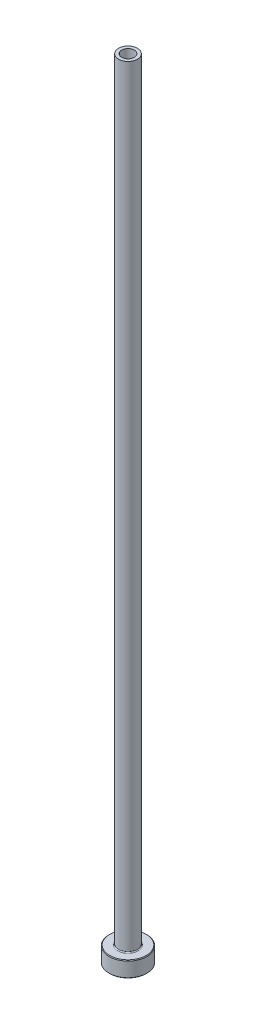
ISO-10303-21;
HEADER;
FILE_DESCRIPTION(('STEP AP214'),'2;1');
FILE_NAME('part.step','',(''),(''),'','','');
FILE_SCHEMA(('AUTOMOTIVE_DESIGN { 1 0 10303 214 1 1 1 1 }'));
ENDSEC;
DATA;
#1=APPLICATION_CONTEXT('core data for automotive mechanical design processes');
#2=APPLICATION_PROTOCOL_DEFINITION('international standard','automotive_design',2000,#1);
#3=PRODUCT_CONTEXT('',#1,'mechanical');
#4=PRODUCT('Part','Part','',(#3));
#5=PRODUCT_RELATED_PRODUCT_CATEGORY('part','',(#4));
#6=PRODUCT_DEFINITION_FORMATION('','',#4);
#7=PRODUCT_DEFINITION_CONTEXT('part definition',#1,'design');
#8=PRODUCT_DEFINITION('design','',#6,#7);
#9=PRODUCT_DEFINITION_SHAPE('','',#8);
#10=(LENGTH_UNIT() NAMED_UNIT(*) SI_UNIT(.MILLI.,.METRE.));
#11=(NAMED_UNIT(*) PLANE_ANGLE_UNIT() SI_UNIT($,.RADIAN.));
#12=(NAMED_UNIT(*) SI_UNIT($,.STERADIAN.) SOLID_ANGLE_UNIT());
#13=UNCERTAINTY_MEASURE_WITH_UNIT(LENGTH_MEASURE(1.E-05),#10,'distance_accuracy_value','');
#14=(GEOMETRIC_REPRESENTATION_CONTEXT(3) GLOBAL_UNCERTAINTY_ASSIGNED_CONTEXT((#13)) GLOBAL_UNIT_ASSIGNED_CONTEXT((#10,
#11,#12)) REPRESENTATION_CONTEXT('',''));
#15=CARTESIAN_POINT('',(0.,0.,0.));
#16=DIRECTION('',(0.,0.,1.));
#17=DIRECTION('',(1.,0.,0.));
#18=AXIS2_PLACEMENT_3D('',#15,#16,#17);
#19=CARTESIAN_POINT('',(0.,92.1876809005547,0.));
#20=DIRECTION('',(0.,1.,0.));
#21=DIRECTION('',(0.,0.,1.));
#22=AXIS2_PLACEMENT_3D('',#19,#20,#21);
#23=CYLINDRICAL_SURFACE('',#22,2.00000000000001);
#24=CARTESIAN_POINT('',(0.,250.,0.));
#25=DIRECTION('',(0.,1.,0.));
#26=DIRECTION('',(0.,0.,1.));
#27=AXIS2_PLACEMENT_3D('',#24,#25,#26);
#28=CIRCLE('',#27,2.00000000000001);
#29=CARTESIAN_POINT('',(0.,250.,2.00000000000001));
#30=VERTEX_POINT('',#29);
#31=EDGE_CURVE('E62',#30,#30,#28,.T.);
#32=ORIENTED_EDGE('',*,*,#31,.T.);
#33=EDGE_LOOP('',(#32));
#34=FACE_BOUND('',#33,.T.);
#35=CARTESIAN_POINT('',(0.,205.,0.));
#36=DIRECTION('',(0.,1.,0.));
#37=DIRECTION('',(0.,0.,1.));
#38=AXIS2_PLACEMENT_3D('',#35,#36,#37);
#39=CIRCLE('',#38,2.00000000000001);
#40=CARTESIAN_POINT('',(0.,205.,2.00000000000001));
#41=VERTEX_POINT('',#40);
#42=EDGE_CURVE('E71',#41,#41,#39,.T.);
#43=ORIENTED_EDGE('',*,*,#42,.F.);
#44=EDGE_LOOP('',(#43));
#45=FACE_BOUND('',#44,.T.);
#46=ADVANCED_FACE('F30',(#34,#45),#23,.F.);
#47=CARTESIAN_POINT('',(-2.00000000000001,250.,0.));
#48=DIRECTION('',(0.,1.,0.));
#49=DIRECTION('',(0.,0.,1.));
#50=AXIS2_PLACEMENT_3D('',#47,#48,#49);
#51=PLANE('',#50);
#52=CARTESIAN_POINT('',(0.,250.,0.));
#53=DIRECTION('',(0.,1.,0.));
#54=DIRECTION('',(0.,0.,1.));
#55=AXIS2_PLACEMENT_3D('',#52,#53,#54);
#56=CIRCLE('',#55,3.00000000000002);
#57=CARTESIAN_POINT('',(0.,250.,3.00000000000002));
#58=VERTEX_POINT('',#57);
#59=EDGE_CURVE('E65',#58,#58,#56,.T.);
#60=ORIENTED_EDGE('',*,*,#59,.T.);
#61=EDGE_LOOP('',(#60));
#62=FACE_BOUND('',#61,.T.);
#63=ORIENTED_EDGE('',*,*,#31,.F.);
#64=EDGE_LOOP('',(#63));
#65=FACE_BOUND('',#64,.T.);
#66=ADVANCED_FACE('F79',(#62,#65),#51,.T.);
#67=CARTESIAN_POINT('',(0.,92.1876809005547,0.));
#68=DIRECTION('',(0.,1.,0.));
#69=DIRECTION('',(0.,0.,1.));
#70=AXIS2_PLACEMENT_3D('',#67,#68,#69);
#71=CYLINDRICAL_SURFACE('',#70,3.);
#72=CARTESIAN_POINT('',(0.,5.3,0.));
#73=DIRECTION('',(0.,1.,0.));
#74=DIRECTION('',(0.,0.,1.));
#75=AXIS2_PLACEMENT_3D('',#72,#73,#74);
#76=CIRCLE('',#75,3.);
#77=CARTESIAN_POINT('',(0.,5.3,3.));
#78=VERTEX_POINT('',#77);
#79=EDGE_CURVE('E59',#78,#78,#76,.T.);
#80=ORIENTED_EDGE('',*,*,#79,.T.);
#81=EDGE_LOOP('',(#80));
#82=FACE_BOUND('',#81,.T.);
#83=ORIENTED_EDGE('',*,*,#59,.F.);
#84=EDGE_LOOP('',(#83));
#85=FACE_BOUND('',#84,.T.);
#86=ADVANCED_FACE('F85',(#82,#85),#71,.T.);
#87=CARTESIAN_POINT('',(-2.99999999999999,5.,0.));
#88=DIRECTION('',(0.,1.,0.));
#89=DIRECTION('',(0.,0.,1.));
#90=AXIS2_PLACEMENT_3D('',#87,#88,#89);
#91=PLANE('',#90);
#92=CARTESIAN_POINT('',(0.,5.,0.));
#93=DIRECTION('',(0.,1.,0.));
#94=DIRECTION('',(0.,0.,1.));
#95=AXIS2_PLACEMENT_3D('',#92,#93,#94);
#96=CIRCLE('',#95,5.79999999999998);
#97=CARTESIAN_POINT('',(0.,5.,5.79999999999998));
#98=VERTEX_POINT('',#97);
#99=EDGE_CURVE('E53',#98,#98,#96,.T.);
#100=ORIENTED_EDGE('',*,*,#99,.T.);
#101=EDGE_LOOP('',(#100));
#102=FACE_BOUND('',#101,.T.);
#103=CARTESIAN_POINT('',(0.,5.,0.));
#104=DIRECTION('',(0.,1.,0.));
#105=DIRECTION('',(0.,0.,1.));
#106=AXIS2_PLACEMENT_3D('',#103,#104,#105);
#107=CIRCLE('',#106,3.3);
#108=CARTESIAN_POINT('',(0.,5.,3.3));
#109=VERTEX_POINT('',#108);
#110=EDGE_CURVE('E56',#109,#109,#107,.F.);
#111=ORIENTED_EDGE('',*,*,#110,.T.);
#112=EDGE_LOOP('',(#111));
#113=FACE_BOUND('',#112,.T.);
#114=ADVANCED_FACE('F111',(#102,#113),#91,.T.);
#115=CARTESIAN_POINT('',(0.,92.1876809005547,0.));
#116=DIRECTION('',(0.,1.,0.));
#117=DIRECTION('',(0.,0.,1.));
#118=AXIS2_PLACEMENT_3D('',#115,#116,#117);
#119=CYLINDRICAL_SURFACE('',#118,5.99999999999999);
#120=CARTESIAN_POINT('',(0.,4.79999999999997,0.));
#121=DIRECTION('',(0.,1.,0.));
#122=DIRECTION('',(0.,0.,1.));
#123=AXIS2_PLACEMENT_3D('',#120,#121,#122);
#124=CIRCLE('',#123,5.99999999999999);
#125=CARTESIAN_POINT('',(0.,4.79999999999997,5.99999999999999));
#126=VERTEX_POINT('',#125);
#127=EDGE_CURVE('E45',#126,#126,#124,.F.);
#128=ORIENTED_EDGE('',*,*,#127,.T.);
#129=EDGE_LOOP('',(#128));
#130=FACE_BOUND('',#129,.T.);
#131=CARTESIAN_POINT('',(0.,0.199999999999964,0.));
#132=DIRECTION('',(0.,-1.,0.));
#133=DIRECTION('',(0.,0.,-1.));
#134=AXIS2_PLACEMENT_3D('',#131,#132,#133);
#135=CIRCLE('',#134,5.99999999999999);
#136=CARTESIAN_POINT('',(0.,0.199999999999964,-5.99999999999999));
#137=VERTEX_POINT('',#136);
#138=EDGE_CURVE('E50',#137,#137,#135,.F.);
#139=ORIENTED_EDGE('',*,*,#138,.T.);
#140=EDGE_LOOP('',(#139));
#141=FACE_BOUND('',#140,.T.);
#142=ADVANCED_FACE('F108',(#130,#141),#119,.T.);
#143=CARTESIAN_POINT('',(-5.99999999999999,0.,0.));
#144=DIRECTION('',(0.,-1.,0.));
#145=DIRECTION('',(0.,0.,-1.));
#146=AXIS2_PLACEMENT_3D('',#143,#144,#145);
#147=PLANE('',#146);
#148=CARTESIAN_POINT('',(0.,0.,0.));
#149=DIRECTION('',(0.,-1.,0.));
#150=DIRECTION('',(0.,0.,-1.));
#151=AXIS2_PLACEMENT_3D('',#148,#149,#150);
#152=CIRCLE('',#151,2.74999999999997);
#153=CARTESIAN_POINT('',(0.,0.,-2.74999999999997));
#154=VERTEX_POINT('',#153);
#155=EDGE_CURVE('E37',#154,#154,#152,.F.);
#156=ORIENTED_EDGE('',*,*,#155,.T.);
#157=EDGE_LOOP('',(#156));
#158=FACE_BOUND('',#157,.T.);
#159=CARTESIAN_POINT('',(0.,0.,0.));
#160=DIRECTION('',(0.,-1.,0.));
#161=DIRECTION('',(0.,0.,-1.));
#162=AXIS2_PLACEMENT_3D('',#159,#160,#161);
#163=CIRCLE('',#162,5.80000000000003);
#164=CARTESIAN_POINT('',(0.,0.,-5.80000000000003));
#165=VERTEX_POINT('',#164);
#166=EDGE_CURVE('E41',#165,#165,#163,.T.);
#167=ORIENTED_EDGE('',*,*,#166,.T.);
#168=EDGE_LOOP('',(#167));
#169=FACE_BOUND('',#168,.T.);
#170=ADVANCED_FACE('F110',(#158,#169),#147,.T.);
#171=CARTESIAN_POINT('',(0.,92.1876809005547,0.));
#172=DIRECTION('',(0.,1.,0.));
#173=DIRECTION('',(0.,0.,1.));
#174=AXIS2_PLACEMENT_3D('',#171,#172,#173);
#175=CYLINDRICAL_SURFACE('',#174,2.25);
#176=CARTESIAN_POINT('',(0.,0.499999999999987,0.));
#177=DIRECTION('',(0.,-1.,0.));
#178=DIRECTION('',(0.,0.,-1.));
#179=AXIS2_PLACEMENT_3D('',#176,#177,#178);
#180=CIRCLE('',#179,2.25);
#181=CARTESIAN_POINT('',(0.,0.499999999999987,-2.25));
#182=VERTEX_POINT('',#181);
#183=EDGE_CURVE('E10',#182,#182,#180,.T.);
#184=ORIENTED_EDGE('',*,*,#183,.T.);
#185=EDGE_LOOP('',(#184));
#186=FACE_BOUND('',#185,.T.);
#187=CARTESIAN_POINT('',(0.,193.,0.));
#188=DIRECTION('',(0.,1.,0.));
#189=DIRECTION('',(0.,0.,1.));
#190=AXIS2_PLACEMENT_3D('',#187,#188,#189);
#191=CIRCLE('',#190,2.25000000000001);
#192=CARTESIAN_POINT('',(0.,193.,2.25000000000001));
#193=VERTEX_POINT('',#192);
#194=EDGE_CURVE('E68',#193,#193,#191,.T.);
#195=ORIENTED_EDGE('',*,*,#194,.T.);
#196=EDGE_LOOP('',(#195));
#197=FACE_BOUND('',#196,.T.);
#198=ADVANCED_FACE('F118',(#186,#197),#175,.F.);
#199=CARTESIAN_POINT('',(0.,193.,0.));
#200=DIRECTION('',(0.,-1.,0.));
#201=DIRECTION('',(0.,0.,-1.));
#202=AXIS2_PLACEMENT_3D('',#199,#200,#201);
#203=CONICAL_SURFACE('',#202,2.25000000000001,0.0208303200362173);
#204=ORIENTED_EDGE('',*,*,#42,.T.);
#205=EDGE_LOOP('',(#204));
#206=FACE_BOUND('',#205,.T.);
#207=ORIENTED_EDGE('',*,*,#194,.F.);
#208=EDGE_LOOP('',(#207));
#209=FACE_BOUND('',#208,.T.);
#210=ADVANCED_FACE('F75',(#206,#209),#203,.F.);
#211=CARTESIAN_POINT('',(0.,5.3,0.));
#212=DIRECTION('',(0.,1.,0.));
#213=DIRECTION('',(0.,0.,1.));
#214=AXIS2_PLACEMENT_3D('',#211,#212,#213);
#215=TOROIDAL_SURFACE('',#214,3.3,0.3);
#216=ORIENTED_EDGE('',*,*,#110,.F.);
#217=EDGE_LOOP('',(#216));
#218=FACE_BOUND('',#217,.T.);
#219=ORIENTED_EDGE('',*,*,#79,.F.);
#220=EDGE_LOOP('',(#219));
#221=FACE_BOUND('',#220,.T.);
#222=ADVANCED_FACE('F90',(#218,#221),#215,.F.);
#223=CARTESIAN_POINT('',(0.,5.,0.));
#224=DIRECTION('',(0.,-1.,0.));
#225=DIRECTION('',(0.,0.,-1.));
#226=AXIS2_PLACEMENT_3D('',#223,#224,#225);
#227=CONICAL_SURFACE('',#226,5.79999999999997,0.785398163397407);
#228=ORIENTED_EDGE('',*,*,#127,.F.);
#229=EDGE_LOOP('',(#228));
#230=FACE_BOUND('',#229,.T.);
#231=ORIENTED_EDGE('',*,*,#99,.F.);
#232=EDGE_LOOP('',(#231));
#233=FACE_BOUND('',#232,.T.);
#234=ADVANCED_FACE('F93',(#230,#233),#227,.T.);
#235=CARTESIAN_POINT('',(0.,0.199999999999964,0.));
#236=DIRECTION('',(0.,1.,0.));
#237=DIRECTION('',(0.,0.,1.));
#238=AXIS2_PLACEMENT_3D('',#235,#236,#237);
#239=CONICAL_SURFACE('',#238,5.99999999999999,0.785398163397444);
#240=ORIENTED_EDGE('',*,*,#166,.F.);
#241=EDGE_LOOP('',(#240));
#242=FACE_BOUND('',#241,.T.);
#243=ORIENTED_EDGE('',*,*,#138,.F.);
#244=EDGE_LOOP('',(#243));
#245=FACE_BOUND('',#244,.T.);
#246=ADVANCED_FACE('F96',(#242,#245),#239,.T.);
#247=CARTESIAN_POINT('',(0.,0.,0.));
#248=DIRECTION('',(0.,-1.,0.));
#249=DIRECTION('',(0.,0.,-1.));
#250=AXIS2_PLACEMENT_3D('',#247,#248,#249);
#251=CONICAL_SURFACE('',#250,2.74999999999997,0.785398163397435);
#252=ORIENTED_EDGE('',*,*,#183,.F.);
#253=EDGE_LOOP('',(#252));
#254=FACE_BOUND('',#253,.T.);
#255=ORIENTED_EDGE('',*,*,#155,.F.);
#256=EDGE_LOOP('',(#255));
#257=FACE_BOUND('',#256,.T.);
#258=ADVANCED_FACE('F32',(#254,#257),#251,.F.);
#259=CLOSED_SHELL('',(#46,#66,#86,#114,#142,#170,#198,#210,#222,#234,#246,#258));
#260=MANIFOLD_SOLID_BREP('B2',#259);
#261=ADVANCED_BREP_SHAPE_REPRESENTATION('',(#18,#260),#14);
#262=SHAPE_DEFINITION_REPRESENTATION(#9,#261);
ENDSEC;
END-ISO-10303-21;
